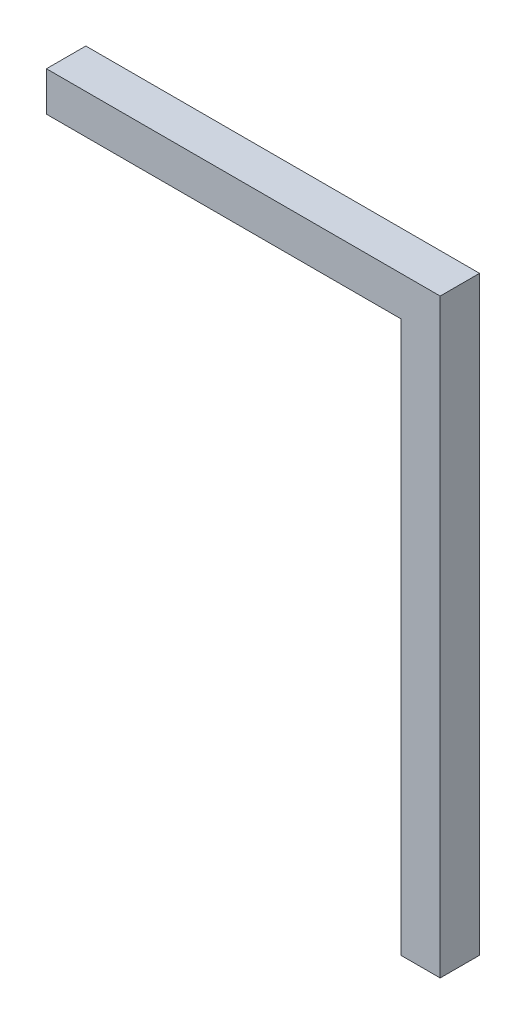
ISO-10303-21;
HEADER;
FILE_DESCRIPTION(('STEP AP214'),'2;1');
FILE_NAME('part.step','',(''),(''),'','','');
FILE_SCHEMA(('AUTOMOTIVE_DESIGN { 1 0 10303 214 1 1 1 1 }'));
ENDSEC;
DATA;
#1=APPLICATION_CONTEXT('core data for automotive mechanical design processes');
#2=APPLICATION_PROTOCOL_DEFINITION('international standard','automotive_design',2000,#1);
#3=PRODUCT_CONTEXT('',#1,'mechanical');
#4=PRODUCT('Part','Part','',(#3));
#5=PRODUCT_RELATED_PRODUCT_CATEGORY('part','',(#4));
#6=PRODUCT_DEFINITION_FORMATION('','',#4);
#7=PRODUCT_DEFINITION_CONTEXT('part definition',#1,'design');
#8=PRODUCT_DEFINITION('design','',#6,#7);
#9=PRODUCT_DEFINITION_SHAPE('','',#8);
#10=(LENGTH_UNIT() NAMED_UNIT(*) SI_UNIT(.MILLI.,.METRE.));
#11=(NAMED_UNIT(*) PLANE_ANGLE_UNIT() SI_UNIT($,.RADIAN.));
#12=(NAMED_UNIT(*) SI_UNIT($,.STERADIAN.) SOLID_ANGLE_UNIT());
#13=UNCERTAINTY_MEASURE_WITH_UNIT(LENGTH_MEASURE(1.E-05),#10,'distance_accuracy_value','');
#14=(GEOMETRIC_REPRESENTATION_CONTEXT(3) GLOBAL_UNCERTAINTY_ASSIGNED_CONTEXT((#13)) GLOBAL_UNIT_ASSIGNED_CONTEXT((#10,
#11,#12)) REPRESENTATION_CONTEXT('',''));
#15=CARTESIAN_POINT('',(0.,0.,0.));
#16=DIRECTION('',(0.,0.,1.));
#17=DIRECTION('',(1.,0.,0.));
#18=AXIS2_PLACEMENT_3D('',#15,#16,#17);
#19=CARTESIAN_POINT('',(-10.,0.,10.));
#20=DIRECTION('',(1.,0.,0.));
#21=DIRECTION('',(0.,1.,0.));
#22=AXIS2_PLACEMENT_3D('',#19,#20,#21);
#23=PLANE('',#22);
#24=DIRECTION('',(0.,-1.,0.));
#25=VECTOR('',#24,1.);
#26=CARTESIAN_POINT('',(-10.,0.,0.));
#27=LINE('',#26,#25);
#28=CARTESIAN_POINT('',(-10.,-10.,0.));
#29=VERTEX_POINT('',#28);
#30=CARTESIAN_POINT('',(-9.99999999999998,-150.,0.));
#31=VERTEX_POINT('',#30);
#32=EDGE_CURVE('E119',#29,#31,#27,.T.);
#33=ORIENTED_EDGE('',*,*,#32,.T.);
#34=DIRECTION('',(0.,0.,-1.));
#35=VECTOR('',#34,1.);
#36=CARTESIAN_POINT('',(-9.99999999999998,-150.,10.));
#37=LINE('',#36,#35);
#38=CARTESIAN_POINT('',(-9.99999999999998,-150.,10.));
#39=VERTEX_POINT('',#38);
#40=EDGE_CURVE('E12',#39,#31,#37,.T.);
#41=ORIENTED_EDGE('',*,*,#40,.F.);
#42=DIRECTION('',(0.,-1.,0.));
#43=VECTOR('',#42,1.);
#44=CARTESIAN_POINT('',(-10.,0.,10.));
#45=LINE('',#44,#43);
#46=CARTESIAN_POINT('',(-10.,-10.,10.));
#47=VERTEX_POINT('',#46);
#48=EDGE_CURVE('E83',#47,#39,#45,.T.);
#49=ORIENTED_EDGE('',*,*,#48,.F.);
#50=DIRECTION('',(0.,0.,-1.));
#51=VECTOR('',#50,1.);
#52=CARTESIAN_POINT('',(-10.,-10.,10.));
#53=LINE('',#52,#51);
#54=EDGE_CURVE('E114',#47,#29,#53,.T.);
#55=ORIENTED_EDGE('',*,*,#54,.T.);
#56=EDGE_LOOP('',(#33,#41,#49,#55));
#57=FACE_BOUND('',#56,.T.);
#58=ADVANCED_FACE('F37',(#57),#23,.F.);
#59=CARTESIAN_POINT('',(0.,-150.,10.));
#60=DIRECTION('',(0.,-1.,0.));
#61=DIRECTION('',(0.,0.,-1.));
#62=AXIS2_PLACEMENT_3D('',#59,#60,#61);
#63=PLANE('',#62);
#64=DIRECTION('',(-1.,0.,0.));
#65=VECTOR('',#64,1.);
#66=CARTESIAN_POINT('',(0.,-150.,0.));
#67=LINE('',#66,#65);
#68=CARTESIAN_POINT('',(0.,-150.,0.));
#69=VERTEX_POINT('',#68);
#70=EDGE_CURVE('E122',#69,#31,#67,.T.);
#71=ORIENTED_EDGE('',*,*,#70,.F.);
#72=DIRECTION('',(0.,0.,-1.));
#73=VECTOR('',#72,1.);
#74=CARTESIAN_POINT('',(0.,-150.,10.));
#75=LINE('',#74,#73);
#76=CARTESIAN_POINT('',(0.,-150.,10.));
#77=VERTEX_POINT('',#76);
#78=EDGE_CURVE('E45',#77,#69,#75,.T.);
#79=ORIENTED_EDGE('',*,*,#78,.F.);
#80=DIRECTION('',(-1.,0.,0.));
#81=VECTOR('',#80,1.);
#82=CARTESIAN_POINT('',(0.,-150.,10.));
#83=LINE('',#82,#81);
#84=EDGE_CURVE('E208',#77,#39,#83,.T.);
#85=ORIENTED_EDGE('',*,*,#84,.T.);
#86=ORIENTED_EDGE('',*,*,#40,.T.);
#87=EDGE_LOOP('',(#71,#79,#85,#86));
#88=FACE_BOUND('',#87,.T.);
#89=ADVANCED_FACE('F140',(#88),#63,.T.);
#90=CARTESIAN_POINT('',(0.,0.,10.));
#91=DIRECTION('',(1.,0.,0.));
#92=DIRECTION('',(0.,1.,0.));
#93=AXIS2_PLACEMENT_3D('',#90,#91,#92);
#94=PLANE('',#93);
#95=DIRECTION('',(0.,-1.,0.));
#96=VECTOR('',#95,1.);
#97=CARTESIAN_POINT('',(0.,0.,0.));
#98=LINE('',#97,#96);
#99=CARTESIAN_POINT('',(0.,0.,0.));
#100=VERTEX_POINT('',#99);
#101=EDGE_CURVE('E125',#100,#69,#98,.T.);
#102=ORIENTED_EDGE('',*,*,#101,.F.);
#103=DIRECTION('',(0.,0.,-1.));
#104=VECTOR('',#103,1.);
#105=CARTESIAN_POINT('',(0.,0.,10.));
#106=LINE('',#105,#104);
#107=CARTESIAN_POINT('',(0.,0.,10.));
#108=VERTEX_POINT('',#107);
#109=EDGE_CURVE('E104',#108,#100,#106,.T.);
#110=ORIENTED_EDGE('',*,*,#109,.F.);
#111=DIRECTION('',(0.,-1.,0.));
#112=VECTOR('',#111,1.);
#113=CARTESIAN_POINT('',(0.,0.,10.));
#114=LINE('',#113,#112);
#115=EDGE_CURVE('E110',#108,#77,#114,.T.);
#116=ORIENTED_EDGE('',*,*,#115,.T.);
#117=ORIENTED_EDGE('',*,*,#78,.T.);
#118=EDGE_LOOP('',(#102,#110,#116,#117));
#119=FACE_BOUND('',#118,.T.);
#120=ADVANCED_FACE('F137',(#119),#94,.T.);
#121=CARTESIAN_POINT('',(-100.,0.,10.));
#122=DIRECTION('',(0.,1.,0.));
#123=DIRECTION('',(0.,0.,1.));
#124=AXIS2_PLACEMENT_3D('',#121,#122,#123);
#125=PLANE('',#124);
#126=DIRECTION('',(1.,0.,0.));
#127=VECTOR('',#126,1.);
#128=CARTESIAN_POINT('',(-100.,0.,0.));
#129=LINE('',#128,#127);
#130=CARTESIAN_POINT('',(-100.,0.,0.));
#131=VERTEX_POINT('',#130);
#132=EDGE_CURVE('E99',#131,#100,#129,.T.);
#133=ORIENTED_EDGE('',*,*,#132,.F.);
#134=DIRECTION('',(0.,0.,-1.));
#135=VECTOR('',#134,1.);
#136=CARTESIAN_POINT('',(-100.,0.,10.));
#137=LINE('',#136,#135);
#138=CARTESIAN_POINT('',(-100.,0.,10.));
#139=VERTEX_POINT('',#138);
#140=EDGE_CURVE('E94',#139,#131,#137,.T.);
#141=ORIENTED_EDGE('',*,*,#140,.F.);
#142=DIRECTION('',(1.,0.,0.));
#143=VECTOR('',#142,1.);
#144=CARTESIAN_POINT('',(-100.,0.,10.));
#145=LINE('',#144,#143);
#146=EDGE_CURVE('E97',#139,#108,#145,.T.);
#147=ORIENTED_EDGE('',*,*,#146,.T.);
#148=ORIENTED_EDGE('',*,*,#109,.T.);
#149=EDGE_LOOP('',(#133,#141,#147,#148));
#150=FACE_BOUND('',#149,.T.);
#151=ADVANCED_FACE('F96',(#150),#125,.T.);
#152=CARTESIAN_POINT('',(-100.,-10.,10.));
#153=DIRECTION('',(-1.,0.,0.));
#154=DIRECTION('',(0.,0.,1.));
#155=AXIS2_PLACEMENT_3D('',#152,#153,#154);
#156=PLANE('',#155);
#157=DIRECTION('',(0.,1.,0.));
#158=VECTOR('',#157,1.);
#159=CARTESIAN_POINT('',(-100.,-10.,0.));
#160=LINE('',#159,#158);
#161=CARTESIAN_POINT('',(-100.,-10.,0.));
#162=VERTEX_POINT('',#161);
#163=EDGE_CURVE('E129',#162,#131,#160,.T.);
#164=ORIENTED_EDGE('',*,*,#163,.F.);
#165=DIRECTION('',(0.,0.,-1.));
#166=VECTOR('',#165,1.);
#167=CARTESIAN_POINT('',(-100.,-10.,10.));
#168=LINE('',#167,#166);
#169=CARTESIAN_POINT('',(-100.,-10.,10.));
#170=VERTEX_POINT('',#169);
#171=EDGE_CURVE('E74',#170,#162,#168,.T.);
#172=ORIENTED_EDGE('',*,*,#171,.F.);
#173=DIRECTION('',(0.,1.,0.));
#174=VECTOR('',#173,1.);
#175=CARTESIAN_POINT('',(-100.,-10.,10.));
#176=LINE('',#175,#174);
#177=EDGE_CURVE('E108',#170,#139,#176,.T.);
#178=ORIENTED_EDGE('',*,*,#177,.T.);
#179=ORIENTED_EDGE('',*,*,#140,.T.);
#180=EDGE_LOOP('',(#164,#172,#178,#179));
#181=FACE_BOUND('',#180,.T.);
#182=ADVANCED_FACE('F112',(#181),#156,.T.);
#183=CARTESIAN_POINT('',(-100.,-10.,10.));
#184=DIRECTION('',(0.,1.,0.));
#185=DIRECTION('',(0.,0.,1.));
#186=AXIS2_PLACEMENT_3D('',#183,#184,#185);
#187=PLANE('',#186);
#188=DIRECTION('',(1.,0.,0.));
#189=VECTOR('',#188,1.);
#190=CARTESIAN_POINT('',(-100.,-10.,0.));
#191=LINE('',#190,#189);
#192=EDGE_CURVE('E77',#162,#29,#191,.T.);
#193=ORIENTED_EDGE('',*,*,#192,.T.);
#194=ORIENTED_EDGE('',*,*,#54,.F.);
#195=DIRECTION('',(1.,0.,0.));
#196=VECTOR('',#195,1.);
#197=CARTESIAN_POINT('',(-100.,-10.,10.));
#198=LINE('',#197,#196);
#199=EDGE_CURVE('E53',#170,#47,#198,.T.);
#200=ORIENTED_EDGE('',*,*,#199,.F.);
#201=ORIENTED_EDGE('',*,*,#171,.T.);
#202=EDGE_LOOP('',(#193,#194,#200,#201));
#203=FACE_BOUND('',#202,.T.);
#204=ADVANCED_FACE('F145',(#203),#187,.F.);
#205=CARTESIAN_POINT('',(-9.99999999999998,-150.,10.));
#206=DIRECTION('',(0.,0.,-1.));
#207=DIRECTION('',(-1.,0.,0.));
#208=AXIS2_PLACEMENT_3D('',#205,#206,#207);
#209=PLANE('',#208);
#210=ORIENTED_EDGE('',*,*,#48,.T.);
#211=ORIENTED_EDGE('',*,*,#84,.F.);
#212=ORIENTED_EDGE('',*,*,#115,.F.);
#213=ORIENTED_EDGE('',*,*,#146,.F.);
#214=ORIENTED_EDGE('',*,*,#177,.F.);
#215=ORIENTED_EDGE('',*,*,#199,.T.);
#216=EDGE_LOOP('',(#210,#211,#212,#213,#214,#215));
#217=FACE_BOUND('',#216,.T.);
#218=ADVANCED_FACE('F107',(#217),#209,.F.);
#219=CARTESIAN_POINT('',(-9.99999999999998,-150.,0.));
#220=DIRECTION('',(0.,0.,-1.));
#221=DIRECTION('',(-1.,0.,0.));
#222=AXIS2_PLACEMENT_3D('',#219,#220,#221);
#223=PLANE('',#222);
#224=ORIENTED_EDGE('',*,*,#32,.F.);
#225=ORIENTED_EDGE('',*,*,#192,.F.);
#226=ORIENTED_EDGE('',*,*,#163,.T.);
#227=ORIENTED_EDGE('',*,*,#132,.T.);
#228=ORIENTED_EDGE('',*,*,#101,.T.);
#229=ORIENTED_EDGE('',*,*,#70,.T.);
#230=EDGE_LOOP('',(#224,#225,#226,#227,#228,#229));
#231=FACE_BOUND('',#230,.T.);
#232=ADVANCED_FACE('F143',(#231),#223,.T.);
#233=CLOSED_SHELL('',(#58,#89,#120,#151,#182,#204,#218,#232));
#234=MANIFOLD_SOLID_BREP('B2',#233);
#235=ADVANCED_BREP_SHAPE_REPRESENTATION('',(#18,#234),#14);
#236=SHAPE_DEFINITION_REPRESENTATION(#9,#235);
ENDSEC;
END-ISO-10303-21;
